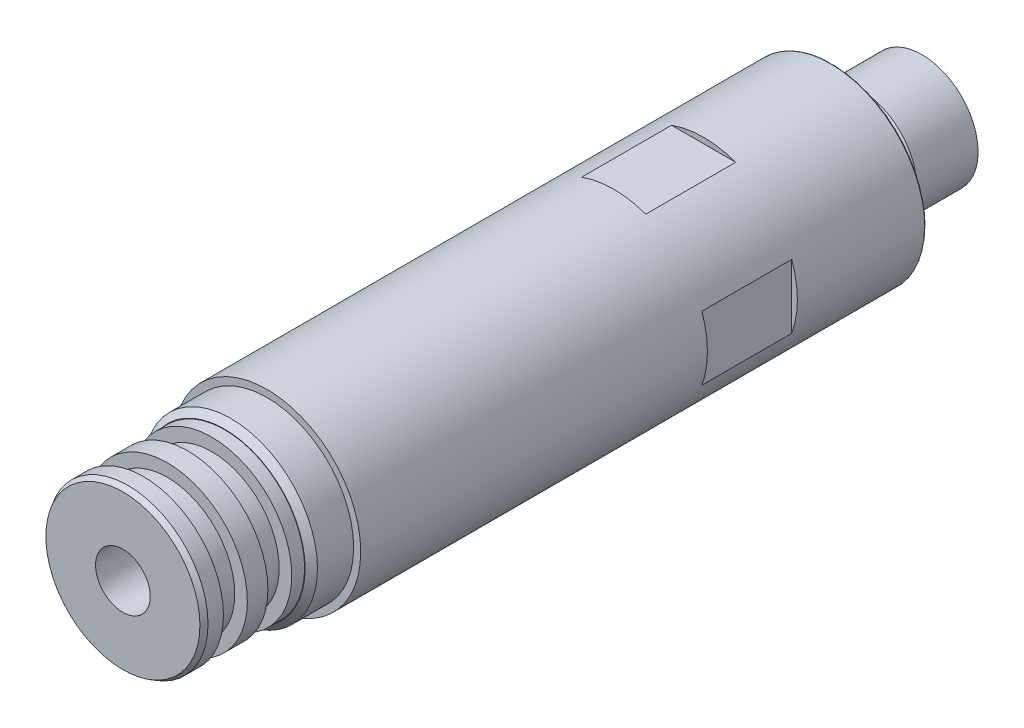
ISO-10303-21;
HEADER;
FILE_DESCRIPTION(('STEP AP214'),'2;1');
FILE_NAME('part.step','',(''),(''),'','','');
FILE_SCHEMA(('AUTOMOTIVE_DESIGN { 1 0 10303 214 1 1 1 1 }'));
ENDSEC;
DATA;
#1=APPLICATION_CONTEXT('core data for automotive mechanical design processes');
#2=APPLICATION_PROTOCOL_DEFINITION('international standard','automotive_design',2000,#1);
#3=PRODUCT_CONTEXT('',#1,'mechanical');
#4=PRODUCT('Part','Part','',(#3));
#5=PRODUCT_RELATED_PRODUCT_CATEGORY('part','',(#4));
#6=PRODUCT_DEFINITION_FORMATION('','',#4);
#7=PRODUCT_DEFINITION_CONTEXT('part definition',#1,'design');
#8=PRODUCT_DEFINITION('design','',#6,#7);
#9=PRODUCT_DEFINITION_SHAPE('','',#8);
#10=(LENGTH_UNIT() NAMED_UNIT(*) SI_UNIT(.MILLI.,.METRE.));
#11=(NAMED_UNIT(*) PLANE_ANGLE_UNIT() SI_UNIT($,.RADIAN.));
#12=(NAMED_UNIT(*) SI_UNIT($,.STERADIAN.) SOLID_ANGLE_UNIT());
#13=UNCERTAINTY_MEASURE_WITH_UNIT(LENGTH_MEASURE(1.E-05),#10,'distance_accuracy_value','');
#14=(GEOMETRIC_REPRESENTATION_CONTEXT(3) GLOBAL_UNCERTAINTY_ASSIGNED_CONTEXT((#13)) GLOBAL_UNIT_ASSIGNED_CONTEXT((#10,
#11,#12)) REPRESENTATION_CONTEXT('',''));
#15=CARTESIAN_POINT('',(0.,0.,0.));
#16=DIRECTION('',(0.,0.,1.));
#17=DIRECTION('',(1.,0.,0.));
#18=AXIS2_PLACEMENT_3D('',#15,#16,#17);
#19=CARTESIAN_POINT('',(0.,0.,65.7352));
#20=DIRECTION('',(0.,0.,-1.));
#21=DIRECTION('',(-1.,0.,0.));
#22=AXIS2_PLACEMENT_3D('',#19,#20,#21);
#23=CYLINDRICAL_SURFACE('',#22,1.5875);
#24=CARTESIAN_POINT('',(0.,0.,-8.89));
#25=DIRECTION('',(0.,0.,-1.));
#26=DIRECTION('',(-1.,0.,0.));
#27=AXIS2_PLACEMENT_3D('',#24,#25,#26);
#28=CIRCLE('',#27,1.5875);
#29=CARTESIAN_POINT('',(-1.5875,0.,-8.89));
#30=VERTEX_POINT('',#29);
#31=EDGE_CURVE('E304',#30,#30,#28,.T.);
#32=ORIENTED_EDGE('',*,*,#31,.T.);
#33=EDGE_LOOP('',(#32));
#34=FACE_BOUND('',#33,.T.);
#35=CARTESIAN_POINT('',(0.,0.,54.8894));
#36=DIRECTION('',(0.,0.,1.));
#37=DIRECTION('',(1.,0.,0.));
#38=AXIS2_PLACEMENT_3D('',#35,#36,#37);
#39=CIRCLE('',#38,1.5875);
#40=CARTESIAN_POINT('',(1.5875,0.,54.8894));
#41=VERTEX_POINT('',#40);
#42=EDGE_CURVE('E280',#41,#41,#39,.F.);
#43=ORIENTED_EDGE('',*,*,#42,.F.);
#44=EDGE_LOOP('',(#43));
#45=FACE_BOUND('',#44,.T.);
#46=ADVANCED_FACE('F36',(#34,#45),#23,.F.);
#47=CARTESIAN_POINT('',(0.,0.,65.7352));
#48=DIRECTION('',(0.,0.,1.));
#49=DIRECTION('',(1.,0.,0.));
#50=AXIS2_PLACEMENT_3D('',#47,#48,#49);
#51=PLANE('',#50);
#52=CARTESIAN_POINT('',(0.,0.,65.7352));
#53=DIRECTION('',(0.,0.,1.));
#54=DIRECTION('',(1.,0.,0.));
#55=AXIS2_PLACEMENT_3D('',#52,#53,#54);
#56=CIRCLE('',#55,7.9121);
#57=CARTESIAN_POINT('',(7.91210000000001,0.,65.7352));
#58=VERTEX_POINT('',#57);
#59=EDGE_CURVE('E309',#58,#58,#56,.T.);
#60=ORIENTED_EDGE('',*,*,#59,.T.);
#61=EDGE_LOOP('',(#60));
#62=FACE_BOUND('',#61,.T.);
#63=CARTESIAN_POINT('',(0.,0.,65.7352));
#64=DIRECTION('',(0.,0.,1.));
#65=DIRECTION('',(1.,0.,0.));
#66=AXIS2_PLACEMENT_3D('',#63,#64,#65);
#67=CIRCLE('',#66,6.6675);
#68=CARTESIAN_POINT('',(6.66750000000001,0.,65.7352));
#69=VERTEX_POINT('',#68);
#70=EDGE_CURVE('E287',#69,#69,#67,.T.);
#71=ORIENTED_EDGE('',*,*,#70,.F.);
#72=EDGE_LOOP('',(#71));
#73=FACE_BOUND('',#72,.T.);
#74=ADVANCED_FACE('F198',(#62,#73),#51,.T.);
#75=CARTESIAN_POINT('',(0.,0.,61.341));
#76=DIRECTION('',(0.,0.,1.));
#77=DIRECTION('',(1.,0.,0.));
#78=AXIS2_PLACEMENT_3D('',#75,#76,#77);
#79=PLANE('',#78);
#80=CARTESIAN_POINT('',(0.,0.,61.341));
#81=DIRECTION('',(0.,0.,1.));
#82=DIRECTION('',(1.,0.,0.));
#83=AXIS2_PLACEMENT_3D('',#80,#81,#82);
#84=CIRCLE('',#83,7.9121);
#85=CARTESIAN_POINT('',(7.91210000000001,0.,61.341));
#86=VERTEX_POINT('',#85);
#87=EDGE_CURVE('E265',#86,#86,#84,.T.);
#88=ORIENTED_EDGE('',*,*,#87,.T.);
#89=EDGE_LOOP('',(#88));
#90=FACE_BOUND('',#89,.T.);
#91=CARTESIAN_POINT('',(0.,0.,61.341));
#92=DIRECTION('',(0.,0.,1.));
#93=DIRECTION('',(1.,0.,0.));
#94=AXIS2_PLACEMENT_3D('',#91,#92,#93);
#95=CIRCLE('',#94,6.6675);
#96=CARTESIAN_POINT('',(6.66750000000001,0.,61.341));
#97=VERTEX_POINT('',#96);
#98=EDGE_CURVE('E312',#97,#97,#95,.T.);
#99=ORIENTED_EDGE('',*,*,#98,.F.);
#100=EDGE_LOOP('',(#99));
#101=FACE_BOUND('',#100,.T.);
#102=ADVANCED_FACE('F204',(#90,#101),#79,.T.);
#103=CARTESIAN_POINT('',(0.,0.,60.071));
#104=DIRECTION('',(0.,0.,1.));
#105=DIRECTION('',(1.,0.,0.));
#106=AXIS2_PLACEMENT_3D('',#103,#104,#105);
#107=PLANE('',#106);
#108=CARTESIAN_POINT('',(0.,0.,60.071));
#109=DIRECTION('',(0.,0.,1.));
#110=DIRECTION('',(1.,0.,0.));
#111=AXIS2_PLACEMENT_3D('',#108,#109,#110);
#112=CIRCLE('',#111,7.9629);
#113=CARTESIAN_POINT('',(7.96290000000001,0.,60.071));
#114=VERTEX_POINT('',#113);
#115=EDGE_CURVE('E160',#114,#114,#112,.T.);
#116=ORIENTED_EDGE('',*,*,#115,.T.);
#117=EDGE_LOOP('',(#116));
#118=FACE_BOUND('',#117,.T.);
#119=CARTESIAN_POINT('',(0.,0.,60.071));
#120=DIRECTION('',(0.,0.,1.));
#121=DIRECTION('',(1.,0.,0.));
#122=AXIS2_PLACEMENT_3D('',#119,#120,#121);
#123=CIRCLE('',#122,7.9121);
#124=CARTESIAN_POINT('',(7.91210000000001,0.,60.071));
#125=VERTEX_POINT('',#124);
#126=EDGE_CURVE('E270',#125,#125,#123,.T.);
#127=ORIENTED_EDGE('',*,*,#126,.F.);
#128=EDGE_LOOP('',(#127));
#129=FACE_BOUND('',#128,.T.);
#130=ADVANCED_FACE('F228',(#118,#129),#107,.T.);
#131=CARTESIAN_POINT('',(0.,0.,55.88));
#132=DIRECTION('',(0.,0.,1.));
#133=DIRECTION('',(1.,0.,0.));
#134=AXIS2_PLACEMENT_3D('',#131,#132,#133);
#135=PLANE('',#134);
#136=CARTESIAN_POINT('',(0.,0.,55.88));
#137=DIRECTION('',(0.,0.,1.));
#138=DIRECTION('',(1.,0.,0.));
#139=AXIS2_PLACEMENT_3D('',#136,#137,#138);
#140=CIRCLE('',#139,9.271);
#141=CARTESIAN_POINT('',(9.27100000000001,0.,55.88));
#142=VERTEX_POINT('',#141);
#143=EDGE_CURVE('E259',#142,#142,#140,.T.);
#144=ORIENTED_EDGE('',*,*,#143,.T.);
#145=EDGE_LOOP('',(#144));
#146=FACE_BOUND('',#145,.T.);
#147=CARTESIAN_POINT('',(0.,0.,55.88));
#148=DIRECTION('',(0.,0.,1.));
#149=DIRECTION('',(1.,0.,0.));
#150=AXIS2_PLACEMENT_3D('',#147,#148,#149);
#151=CIRCLE('',#150,8.5725);
#152=CARTESIAN_POINT('',(8.57250000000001,0.,55.88));
#153=VERTEX_POINT('',#152);
#154=EDGE_CURVE('E262',#153,#153,#151,.T.);
#155=ORIENTED_EDGE('',*,*,#154,.F.);
#156=EDGE_LOOP('',(#155));
#157=FACE_BOUND('',#156,.T.);
#158=ADVANCED_FACE('F236',(#146,#157),#135,.T.);
#159=CARTESIAN_POINT('',(0.,0.,0.));
#160=DIRECTION('',(0.,0.,1.));
#161=DIRECTION('',(1.,0.,0.));
#162=AXIS2_PLACEMENT_3D('',#159,#160,#161);
#163=PLANE('',#162);
#164=CARTESIAN_POINT('',(0.,0.,0.));
#165=DIRECTION('',(0.,0.,1.));
#166=DIRECTION('',(1.,0.,0.));
#167=AXIS2_PLACEMENT_3D('',#164,#165,#166);
#168=CIRCLE('',#167,9.144);
#169=CARTESIAN_POINT('',(9.14400000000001,0.,0.));
#170=VERTEX_POINT('',#169);
#171=EDGE_CURVE('E12',#170,#170,#168,.F.);
#172=ORIENTED_EDGE('',*,*,#171,.T.);
#173=EDGE_LOOP('',(#172));
#174=FACE_BOUND('',#173,.T.);
#175=CARTESIAN_POINT('',(0.,0.,0.));
#176=DIRECTION('',(0.,0.,1.));
#177=DIRECTION('',(1.,0.,0.));
#178=AXIS2_PLACEMENT_3D('',#175,#176,#177);
#179=CIRCLE('',#178,5.2578);
#180=CARTESIAN_POINT('',(5.25780000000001,0.,0.));
#181=VERTEX_POINT('',#180);
#182=EDGE_CURVE('E169',#181,#181,#179,.T.);
#183=ORIENTED_EDGE('',*,*,#182,.T.);
#184=EDGE_LOOP('',(#183));
#185=FACE_BOUND('',#184,.T.);
#186=ADVANCED_FACE('F249',(#174,#185),#163,.F.);
#187=CARTESIAN_POINT('',(0.,0.,55.88));
#188=DIRECTION('',(0.,0.,-1.));
#189=DIRECTION('',(-1.,0.,0.));
#190=AXIS2_PLACEMENT_3D('',#187,#188,#189);
#191=CYLINDRICAL_SURFACE('',#190,9.271);
#192=CARTESIAN_POINT('',(0.,0.,0.127000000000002));
#193=DIRECTION('',(0.,0.,1.));
#194=DIRECTION('',(1.,0.,0.));
#195=AXIS2_PLACEMENT_3D('',#192,#193,#194);
#196=CIRCLE('',#195,9.271);
#197=CARTESIAN_POINT('',(9.27100000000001,0.,0.127000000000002));
#198=VERTEX_POINT('',#197);
#199=EDGE_CURVE('E44',#198,#198,#196,.T.);
#200=ORIENTED_EDGE('',*,*,#199,.T.);
#201=EDGE_LOOP('',(#200));
#202=FACE_BOUND('',#201,.T.);
#203=CARTESIAN_POINT('',(0.,0.,21.59));
#204=DIRECTION('',(0.,0.,1.));
#205=DIRECTION('',(1.,0.,0.));
#206=AXIS2_PLACEMENT_3D('',#203,#204,#205);
#207=CIRCLE('',#206,9.271);
#208=CARTESIAN_POINT('',(-8.71220000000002,3.17001769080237,21.59));
#209=VERTEX_POINT('',#208);
#210=CARTESIAN_POINT('',(-8.71220000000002,-3.17001769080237,21.59));
#211=VERTEX_POINT('',#210);
#212=EDGE_CURVE('E126',#209,#211,#207,.T.);
#213=ORIENTED_EDGE('',*,*,#212,.T.);
#214=DIRECTION('',(0.,0.,-1.));
#215=VECTOR('',#214,1.);
#216=CARTESIAN_POINT('',(-8.71220000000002,-3.17001769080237,55.88));
#217=LINE('',#216,#215);
#218=CARTESIAN_POINT('',(-8.71220000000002,-3.17001769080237,12.7));
#219=VERTEX_POINT('',#218);
#220=EDGE_CURVE('E157',#211,#219,#217,.T.);
#221=ORIENTED_EDGE('',*,*,#220,.T.);
#222=CARTESIAN_POINT('',(0.,0.,12.7));
#223=DIRECTION('',(0.,0.,1.));
#224=DIRECTION('',(1.,0.,0.));
#225=AXIS2_PLACEMENT_3D('',#222,#223,#224);
#226=CIRCLE('',#225,9.271);
#227=CARTESIAN_POINT('',(-8.71220000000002,3.17001769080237,12.7));
#228=VERTEX_POINT('',#227);
#229=EDGE_CURVE('E123',#228,#219,#226,.T.);
#230=ORIENTED_EDGE('',*,*,#229,.F.);
#231=DIRECTION('',(0.,0.,-1.));
#232=VECTOR('',#231,1.);
#233=CARTESIAN_POINT('',(-8.71220000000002,3.17001769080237,55.88));
#234=LINE('',#233,#232);
#235=EDGE_CURVE('E128',#228,#209,#234,.F.);
#236=ORIENTED_EDGE('',*,*,#235,.T.);
#237=EDGE_LOOP('',(#213,#221,#230,#236));
#238=FACE_BOUND('',#237,.T.);
#239=CARTESIAN_POINT('',(-3.17001769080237,-8.71220000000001,21.59));
#240=VERTEX_POINT('',#239);
#241=CARTESIAN_POINT('',(3.17001769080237,-8.71220000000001,21.59));
#242=VERTEX_POINT('',#241);
#243=EDGE_CURVE('E137',#240,#242,#207,.T.);
#244=ORIENTED_EDGE('',*,*,#243,.T.);
#245=DIRECTION('',(0.,0.,-1.));
#246=VECTOR('',#245,1.);
#247=CARTESIAN_POINT('',(3.17001769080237,-8.71220000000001,55.88));
#248=LINE('',#247,#246);
#249=CARTESIAN_POINT('',(3.17001769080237,-8.71220000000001,12.7));
#250=VERTEX_POINT('',#249);
#251=EDGE_CURVE('E146',#242,#250,#248,.T.);
#252=ORIENTED_EDGE('',*,*,#251,.T.);
#253=CARTESIAN_POINT('',(-3.17001769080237,-8.71220000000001,12.7));
#254=VERTEX_POINT('',#253);
#255=EDGE_CURVE('E129',#254,#250,#226,.T.);
#256=ORIENTED_EDGE('',*,*,#255,.F.);
#257=DIRECTION('',(0.,0.,-1.));
#258=VECTOR('',#257,1.);
#259=CARTESIAN_POINT('',(-3.17001769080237,-8.71220000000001,55.88));
#260=LINE('',#259,#258);
#261=EDGE_CURVE('E140',#254,#240,#260,.F.);
#262=ORIENTED_EDGE('',*,*,#261,.T.);
#263=EDGE_LOOP('',(#244,#252,#256,#262));
#264=FACE_BOUND('',#263,.T.);
#265=CARTESIAN_POINT('',(8.7122,-3.17001769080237,21.59));
#266=VERTEX_POINT('',#265);
#267=CARTESIAN_POINT('',(8.7122,3.17001769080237,21.59));
#268=VERTEX_POINT('',#267);
#269=EDGE_CURVE('E127',#266,#268,#207,.T.);
#270=ORIENTED_EDGE('',*,*,#269,.T.);
#271=DIRECTION('',(0.,0.,-1.));
#272=VECTOR('',#271,1.);
#273=CARTESIAN_POINT('',(8.7122,3.17001769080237,55.88));
#274=LINE('',#273,#272);
#275=CARTESIAN_POINT('',(8.7122,3.17001769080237,12.7));
#276=VERTEX_POINT('',#275);
#277=EDGE_CURVE('E136',#268,#276,#274,.T.);
#278=ORIENTED_EDGE('',*,*,#277,.T.);
#279=CARTESIAN_POINT('',(8.7122,-3.17001769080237,12.7));
#280=VERTEX_POINT('',#279);
#281=EDGE_CURVE('E124',#280,#276,#226,.T.);
#282=ORIENTED_EDGE('',*,*,#281,.F.);
#283=DIRECTION('',(0.,0.,-1.));
#284=VECTOR('',#283,1.);
#285=CARTESIAN_POINT('',(8.7122,-3.17001769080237,55.88));
#286=LINE('',#285,#284);
#287=EDGE_CURVE('E130',#280,#266,#286,.F.);
#288=ORIENTED_EDGE('',*,*,#287,.T.);
#289=EDGE_LOOP('',(#270,#278,#282,#288));
#290=FACE_BOUND('',#289,.T.);
#291=CARTESIAN_POINT('',(3.17001769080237,8.71220000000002,21.59));
#292=VERTEX_POINT('',#291);
#293=CARTESIAN_POINT('',(-3.17001769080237,8.71220000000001,21.59));
#294=VERTEX_POINT('',#293);
#295=EDGE_CURVE('E121',#292,#294,#207,.T.);
#296=ORIENTED_EDGE('',*,*,#295,.T.);
#297=DIRECTION('',(0.,0.,-1.));
#298=VECTOR('',#297,1.);
#299=CARTESIAN_POINT('',(-3.17001769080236,8.71220000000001,55.88));
#300=LINE('',#299,#298);
#301=CARTESIAN_POINT('',(-3.17001769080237,8.7122,12.7));
#302=VERTEX_POINT('',#301);
#303=EDGE_CURVE('E120',#294,#302,#300,.T.);
#304=ORIENTED_EDGE('',*,*,#303,.T.);
#305=CARTESIAN_POINT('',(3.17001769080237,8.71220000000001,12.7));
#306=VERTEX_POINT('',#305);
#307=EDGE_CURVE('E112',#306,#302,#226,.T.);
#308=ORIENTED_EDGE('',*,*,#307,.F.);
#309=DIRECTION('',(0.,0.,-1.));
#310=VECTOR('',#309,1.);
#311=CARTESIAN_POINT('',(3.17001769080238,8.71220000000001,55.88));
#312=LINE('',#311,#310);
#313=EDGE_CURVE('E101',#306,#292,#312,.F.);
#314=ORIENTED_EDGE('',*,*,#313,.T.);
#315=EDGE_LOOP('',(#296,#304,#308,#314));
#316=FACE_BOUND('',#315,.T.);
#317=ORIENTED_EDGE('',*,*,#143,.F.);
#318=EDGE_LOOP('',(#317));
#319=FACE_BOUND('',#318,.T.);
#320=ADVANCED_FACE('F38',(#202,#238,#264,#290,#316,#319),#191,.T.);
#321=CARTESIAN_POINT('',(0.,0.,-8.89));
#322=DIRECTION('',(0.,0.,1.));
#323=DIRECTION('',(1.,0.,0.));
#324=AXIS2_PLACEMENT_3D('',#321,#322,#323);
#325=CYLINDRICAL_SURFACE('',#324,5.55625);
#326=CARTESIAN_POINT('',(0.,0.,-2.8321));
#327=DIRECTION('',(0.,0.,-1.));
#328=DIRECTION('',(-1.,0.,0.));
#329=AXIS2_PLACEMENT_3D('',#326,#327,#328);
#330=CIRCLE('',#329,5.55625);
#331=CARTESIAN_POINT('',(-5.55625000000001,0.,-2.8321));
#332=VERTEX_POINT('',#331);
#333=EDGE_CURVE('E172',#332,#332,#330,.T.);
#334=ORIENTED_EDGE('',*,*,#333,.T.);
#335=EDGE_LOOP('',(#334));
#336=FACE_BOUND('',#335,.T.);
#337=CARTESIAN_POINT('',(0.,0.,-8.89));
#338=DIRECTION('',(0.,0.,-1.));
#339=DIRECTION('',(-1.,0.,0.));
#340=AXIS2_PLACEMENT_3D('',#337,#338,#339);
#341=CIRCLE('',#340,5.55625);
#342=CARTESIAN_POINT('',(-5.55625000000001,0.,-8.89));
#343=VERTEX_POINT('',#342);
#344=EDGE_CURVE('E264',#343,#343,#341,.T.);
#345=ORIENTED_EDGE('',*,*,#344,.F.);
#346=EDGE_LOOP('',(#345));
#347=FACE_BOUND('',#346,.T.);
#348=ADVANCED_FACE('F244',(#336,#347),#325,.T.);
#349=CARTESIAN_POINT('',(0.,0.,-8.89));
#350=DIRECTION('',(0.,0.,-1.));
#351=DIRECTION('',(-1.,0.,0.));
#352=AXIS2_PLACEMENT_3D('',#349,#350,#351);
#353=PLANE('',#352);
#354=ORIENTED_EDGE('',*,*,#31,.F.);
#355=EDGE_LOOP('',(#354));
#356=FACE_BOUND('',#355,.T.);
#357=ORIENTED_EDGE('',*,*,#344,.T.);
#358=EDGE_LOOP('',(#357));
#359=FACE_BOUND('',#358,.T.);
#360=ADVANCED_FACE('F240',(#356,#359),#353,.T.);
#361=CARTESIAN_POINT('',(0.,0.,57.15));
#362=DIRECTION('',(0.,0.,-1.));
#363=DIRECTION('',(-1.,0.,0.));
#364=AXIS2_PLACEMENT_3D('',#361,#362,#363);
#365=CYLINDRICAL_SURFACE('',#364,8.5725);
#366=CARTESIAN_POINT('',(0.,0.,59.4614));
#367=DIRECTION('',(0.,0.,1.));
#368=DIRECTION('',(1.,0.,0.));
#369=AXIS2_PLACEMENT_3D('',#366,#367,#368);
#370=CIRCLE('',#369,8.5725);
#371=CARTESIAN_POINT('',(8.57250000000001,0.,59.4614));
#372=VERTEX_POINT('',#371);
#373=EDGE_CURVE('E163',#372,#372,#370,.F.);
#374=ORIENTED_EDGE('',*,*,#373,.T.);
#375=EDGE_LOOP('',(#374));
#376=FACE_BOUND('',#375,.T.);
#377=ORIENTED_EDGE('',*,*,#154,.T.);
#378=EDGE_LOOP('',(#377));
#379=FACE_BOUND('',#378,.T.);
#380=ADVANCED_FACE('F232',(#376,#379),#365,.T.);
#381=CARTESIAN_POINT('',(0.,0.,61.341));
#382=DIRECTION('',(0.,0.,-1.));
#383=DIRECTION('',(-1.,0.,0.));
#384=AXIS2_PLACEMENT_3D('',#381,#382,#383);
#385=CYLINDRICAL_SURFACE('',#384,7.9121);
#386=ORIENTED_EDGE('',*,*,#87,.F.);
#387=EDGE_LOOP('',(#386));
#388=FACE_BOUND('',#387,.T.);
#389=ORIENTED_EDGE('',*,*,#126,.T.);
#390=EDGE_LOOP('',(#389));
#391=FACE_BOUND('',#390,.T.);
#392=ADVANCED_FACE('F224',(#388,#391),#385,.T.);
#393=CARTESIAN_POINT('',(0.,0.,63.7032));
#394=DIRECTION('',(0.,0.,-1.));
#395=DIRECTION('',(-1.,0.,0.));
#396=AXIS2_PLACEMENT_3D('',#393,#394,#395);
#397=CYLINDRICAL_SURFACE('',#396,6.6675);
#398=CARTESIAN_POINT('',(0.,0.,63.7032));
#399=DIRECTION('',(0.,0.,1.));
#400=DIRECTION('',(1.,0.,0.));
#401=AXIS2_PLACEMENT_3D('',#398,#399,#400);
#402=CIRCLE('',#401,6.6675);
#403=CARTESIAN_POINT('',(6.66750000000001,0.,63.7032));
#404=VERTEX_POINT('',#403);
#405=EDGE_CURVE('E315',#404,#404,#402,.T.);
#406=ORIENTED_EDGE('',*,*,#405,.F.);
#407=EDGE_LOOP('',(#406));
#408=FACE_BOUND('',#407,.T.);
#409=ORIENTED_EDGE('',*,*,#98,.T.);
#410=EDGE_LOOP('',(#409));
#411=FACE_BOUND('',#410,.T.);
#412=ADVANCED_FACE('F216',(#408,#411),#397,.T.);
#413=CARTESIAN_POINT('',(0.,0.,63.7032));
#414=DIRECTION('',(0.,0.,1.));
#415=DIRECTION('',(1.,0.,0.));
#416=AXIS2_PLACEMENT_3D('',#413,#414,#415);
#417=PLANE('',#416);
#418=CARTESIAN_POINT('',(0.,0.,63.7032));
#419=DIRECTION('',(0.,0.,1.));
#420=DIRECTION('',(1.,0.,0.));
#421=AXIS2_PLACEMENT_3D('',#418,#419,#420);
#422=CIRCLE('',#421,7.9121);
#423=CARTESIAN_POINT('',(7.91210000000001,0.,63.7032));
#424=VERTEX_POINT('',#423);
#425=EDGE_CURVE('E306',#424,#424,#422,.T.);
#426=ORIENTED_EDGE('',*,*,#425,.F.);
#427=EDGE_LOOP('',(#426));
#428=FACE_BOUND('',#427,.T.);
#429=ORIENTED_EDGE('',*,*,#405,.T.);
#430=EDGE_LOOP('',(#429));
#431=FACE_BOUND('',#430,.T.);
#432=ADVANCED_FACE('F213',(#428,#431),#417,.F.);
#433=CARTESIAN_POINT('',(0.,0.,65.7352));
#434=DIRECTION('',(0.,0.,-1.));
#435=DIRECTION('',(-1.,0.,0.));
#436=AXIS2_PLACEMENT_3D('',#433,#434,#435);
#437=CYLINDRICAL_SURFACE('',#436,7.9121);
#438=ORIENTED_EDGE('',*,*,#59,.F.);
#439=EDGE_LOOP('',(#438));
#440=FACE_BOUND('',#439,.T.);
#441=ORIENTED_EDGE('',*,*,#425,.T.);
#442=EDGE_LOOP('',(#441));
#443=FACE_BOUND('',#442,.T.);
#444=ADVANCED_FACE('F215',(#440,#443),#437,.T.);
#445=CARTESIAN_POINT('',(0.,0.,68.0974));
#446=DIRECTION('',(0.,0.,-1.));
#447=DIRECTION('',(-1.,0.,0.));
#448=AXIS2_PLACEMENT_3D('',#445,#446,#447);
#449=CYLINDRICAL_SURFACE('',#448,6.6675);
#450=CARTESIAN_POINT('',(0.,0.,68.0974));
#451=DIRECTION('',(0.,0.,1.));
#452=DIRECTION('',(1.,0.,0.));
#453=AXIS2_PLACEMENT_3D('',#450,#451,#452);
#454=CIRCLE('',#453,6.6675);
#455=CARTESIAN_POINT('',(6.66750000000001,0.,68.0974));
#456=VERTEX_POINT('',#455);
#457=EDGE_CURVE('E301',#456,#456,#454,.T.);
#458=ORIENTED_EDGE('',*,*,#457,.F.);
#459=EDGE_LOOP('',(#458));
#460=FACE_BOUND('',#459,.T.);
#461=ORIENTED_EDGE('',*,*,#70,.T.);
#462=EDGE_LOOP('',(#461));
#463=FACE_BOUND('',#462,.T.);
#464=ADVANCED_FACE('F211',(#460,#463),#449,.T.);
#465=CARTESIAN_POINT('',(0.,0.,68.0974));
#466=DIRECTION('',(0.,0.,1.));
#467=DIRECTION('',(1.,0.,0.));
#468=AXIS2_PLACEMENT_3D('',#465,#466,#467);
#469=PLANE('',#468);
#470=CARTESIAN_POINT('',(0.,0.,68.0974));
#471=DIRECTION('',(0.,0.,1.));
#472=DIRECTION('',(1.,0.,0.));
#473=AXIS2_PLACEMENT_3D('',#470,#471,#472);
#474=CIRCLE('',#473,7.9121);
#475=CARTESIAN_POINT('',(7.91210000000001,0.,68.0974));
#476=VERTEX_POINT('',#475);
#477=EDGE_CURVE('E282',#476,#476,#474,.T.);
#478=ORIENTED_EDGE('',*,*,#477,.F.);
#479=EDGE_LOOP('',(#478));
#480=FACE_BOUND('',#479,.T.);
#481=ORIENTED_EDGE('',*,*,#457,.T.);
#482=EDGE_LOOP('',(#481));
#483=FACE_BOUND('',#482,.T.);
#484=ADVANCED_FACE('F333',(#480,#483),#469,.F.);
#485=CARTESIAN_POINT('',(0.,0.,70.1294));
#486=DIRECTION('',(0.,0.,-1.));
#487=DIRECTION('',(-1.,0.,0.));
#488=AXIS2_PLACEMENT_3D('',#485,#486,#487);
#489=CYLINDRICAL_SURFACE('',#488,7.9121);
#490=CARTESIAN_POINT('',(0.,0.,69.6214));
#491=DIRECTION('',(0.,0.,1.));
#492=DIRECTION('',(1.,0.,0.));
#493=AXIS2_PLACEMENT_3D('',#490,#491,#492);
#494=CIRCLE('',#493,7.9121);
#495=CARTESIAN_POINT('',(7.91210000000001,0.,69.6214));
#496=VERTEX_POINT('',#495);
#497=EDGE_CURVE('E113',#496,#496,#494,.F.);
#498=ORIENTED_EDGE('',*,*,#497,.T.);
#499=EDGE_LOOP('',(#498));
#500=FACE_BOUND('',#499,.T.);
#501=ORIENTED_EDGE('',*,*,#477,.T.);
#502=EDGE_LOOP('',(#501));
#503=FACE_BOUND('',#502,.T.);
#504=ADVANCED_FACE('F338',(#500,#503),#489,.T.);
#505=CARTESIAN_POINT('',(0.,0.,70.1294));
#506=DIRECTION('',(0.,0.,1.));
#507=DIRECTION('',(1.,0.,0.));
#508=AXIS2_PLACEMENT_3D('',#505,#506,#507);
#509=PLANE('',#508);
#510=CARTESIAN_POINT('',(0.,0.,70.1294));
#511=DIRECTION('',(0.,0.,1.));
#512=DIRECTION('',(1.,0.,0.));
#513=AXIS2_PLACEMENT_3D('',#510,#511,#512);
#514=CIRCLE('',#513,2.7051);
#515=CARTESIAN_POINT('',(2.7051,0.,70.1294));
#516=VERTEX_POINT('',#515);
#517=EDGE_CURVE('E290',#516,#516,#514,.T.);
#518=ORIENTED_EDGE('',*,*,#517,.F.);
#519=EDGE_LOOP('',(#518));
#520=FACE_BOUND('',#519,.T.);
#521=CARTESIAN_POINT('',(0.,0.,70.1294));
#522=DIRECTION('',(0.,0.,1.));
#523=DIRECTION('',(1.,0.,0.));
#524=AXIS2_PLACEMENT_3D('',#521,#522,#523);
#525=CIRCLE('',#524,7.61880606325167);
#526=CARTESIAN_POINT('',(7.61880606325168,0.,70.1294));
#527=VERTEX_POINT('',#526);
#528=EDGE_CURVE('E275',#527,#527,#525,.T.);
#529=ORIENTED_EDGE('',*,*,#528,.T.);
#530=EDGE_LOOP('',(#529));
#531=FACE_BOUND('',#530,.T.);
#532=ADVANCED_FACE('F346',(#520,#531),#509,.T.);
#533=CARTESIAN_POINT('',(0.,0.,70.1294));
#534=DIRECTION('',(0.,0.,-1.));
#535=DIRECTION('',(-1.,0.,0.));
#536=AXIS2_PLACEMENT_3D('',#533,#534,#535);
#537=CONICAL_SURFACE('',#536,7.61880606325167,0.52359877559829);
#538=ORIENTED_EDGE('',*,*,#497,.F.);
#539=EDGE_LOOP('',(#538));
#540=FACE_BOUND('',#539,.T.);
#541=ORIENTED_EDGE('',*,*,#528,.F.);
#542=EDGE_LOOP('',(#541));
#543=FACE_BOUND('',#542,.T.);
#544=ADVANCED_FACE('F351',(#540,#543),#537,.T.);
#545=CARTESIAN_POINT('',(0.,0.,54.8894));
#546=DIRECTION('',(0.,0.,1.));
#547=DIRECTION('',(1.,0.,0.));
#548=AXIS2_PLACEMENT_3D('',#545,#546,#547);
#549=PLANE('',#548);
#550=CARTESIAN_POINT('',(0.,0.,54.8894));
#551=DIRECTION('',(0.,0.,1.));
#552=DIRECTION('',(1.,0.,0.));
#553=AXIS2_PLACEMENT_3D('',#550,#551,#552);
#554=CIRCLE('',#553,2.7051);
#555=CARTESIAN_POINT('',(2.7051,0.,54.8894));
#556=VERTEX_POINT('',#555);
#557=EDGE_CURVE('E283',#556,#556,#554,.T.);
#558=ORIENTED_EDGE('',*,*,#557,.T.);
#559=EDGE_LOOP('',(#558));
#560=FACE_BOUND('',#559,.T.);
#561=ORIENTED_EDGE('',*,*,#42,.T.);
#562=EDGE_LOOP('',(#561));
#563=FACE_BOUND('',#562,.T.);
#564=ADVANCED_FACE('F358',(#560,#563),#549,.T.);
#565=CARTESIAN_POINT('',(0.,0.,54.8894));
#566=DIRECTION('',(0.,0.,1.));
#567=DIRECTION('',(1.,0.,0.));
#568=AXIS2_PLACEMENT_3D('',#565,#566,#567);
#569=CYLINDRICAL_SURFACE('',#568,2.7051);
#570=CARTESIAN_POINT('',(2.7051,0.,54.8894));
#571=CARTESIAN_POINT('',(2.7051,0.,55.04815));
#572=CARTESIAN_POINT('',(2.7051,0.,55.2069));
#573=CARTESIAN_POINT('',(2.7051,0.,55.5244));
#574=CARTESIAN_POINT('',(2.7051,0.,55.68315));
#575=CARTESIAN_POINT('',(2.7051,0.,56.00065));
#576=CARTESIAN_POINT('',(2.7051,0.,56.1594));
#577=CARTESIAN_POINT('',(2.7051,0.,56.4769));
#578=CARTESIAN_POINT('',(2.7051,0.,56.63565));
#579=CARTESIAN_POINT('',(2.7051,0.,56.95315));
#580=CARTESIAN_POINT('',(2.7051,0.,57.1119));
#581=CARTESIAN_POINT('',(2.7051,0.,57.4294));
#582=CARTESIAN_POINT('',(2.7051,0.,57.58815));
#583=CARTESIAN_POINT('',(2.7051,0.,57.90565));
#584=CARTESIAN_POINT('',(2.7051,0.,58.0644));
#585=CARTESIAN_POINT('',(2.7051,0.,58.3819));
#586=CARTESIAN_POINT('',(2.7051,0.,58.54065));
#587=CARTESIAN_POINT('',(2.7051,0.,58.85815));
#588=CARTESIAN_POINT('',(2.7051,0.,59.0169));
#589=CARTESIAN_POINT('',(2.7051,0.,59.3344));
#590=CARTESIAN_POINT('',(2.7051,0.,59.49315));
#591=CARTESIAN_POINT('',(2.7051,0.,59.81065));
#592=CARTESIAN_POINT('',(2.7051,0.,59.9694));
#593=CARTESIAN_POINT('',(2.7051,0.,60.2869));
#594=CARTESIAN_POINT('',(2.7051,0.,60.44565));
#595=CARTESIAN_POINT('',(2.7051,0.,60.76315));
#596=CARTESIAN_POINT('',(2.7051,0.,60.9219));
#597=CARTESIAN_POINT('',(2.7051,0.,61.2394));
#598=CARTESIAN_POINT('',(2.7051,0.,61.39815));
#599=CARTESIAN_POINT('',(2.7051,0.,61.71565));
#600=CARTESIAN_POINT('',(2.7051,0.,61.8744));
#601=CARTESIAN_POINT('',(2.7051,0.,62.1919));
#602=CARTESIAN_POINT('',(2.7051,0.,62.35065));
#603=CARTESIAN_POINT('',(2.7051,0.,62.66815));
#604=CARTESIAN_POINT('',(2.7051,0.,62.8269));
#605=CARTESIAN_POINT('',(2.7051,0.,63.1444));
#606=CARTESIAN_POINT('',(2.7051,0.,63.30315));
#607=CARTESIAN_POINT('',(2.7051,0.,63.62065));
#608=CARTESIAN_POINT('',(2.7051,0.,63.7794));
#609=CARTESIAN_POINT('',(2.7051,0.,64.0969));
#610=CARTESIAN_POINT('',(2.7051,0.,64.25565));
#611=CARTESIAN_POINT('',(2.7051,0.,64.57315));
#612=CARTESIAN_POINT('',(2.7051,0.,64.7319));
#613=CARTESIAN_POINT('',(2.7051,0.,65.0494));
#614=CARTESIAN_POINT('',(2.7051,0.,65.20815));
#615=CARTESIAN_POINT('',(2.7051,0.,65.52565));
#616=CARTESIAN_POINT('',(2.7051,0.,65.6844));
#617=CARTESIAN_POINT('',(2.7051,0.,66.0019));
#618=CARTESIAN_POINT('',(2.7051,0.,66.16065));
#619=CARTESIAN_POINT('',(2.7051,0.,66.47815));
#620=CARTESIAN_POINT('',(2.7051,0.,66.6369));
#621=CARTESIAN_POINT('',(2.7051,0.,66.9544));
#622=CARTESIAN_POINT('',(2.7051,0.,67.11315));
#623=CARTESIAN_POINT('',(2.7051,0.,67.43065));
#624=CARTESIAN_POINT('',(2.7051,0.,67.5894));
#625=CARTESIAN_POINT('',(2.7051,0.,67.9069));
#626=CARTESIAN_POINT('',(2.7051,0.,68.06565));
#627=CARTESIAN_POINT('',(2.7051,0.,68.38315));
#628=CARTESIAN_POINT('',(2.7051,0.,68.5419));
#629=CARTESIAN_POINT('',(2.7051,0.,68.8594));
#630=CARTESIAN_POINT('',(2.7051,0.,69.01815));
#631=CARTESIAN_POINT('',(2.7051,0.,69.33565));
#632=CARTESIAN_POINT('',(2.7051,0.,69.4944));
#633=CARTESIAN_POINT('',(2.7051,0.,69.8119));
#634=CARTESIAN_POINT('',(2.7051,0.,69.97065));
#635=CARTESIAN_POINT('',(2.7051,0.,70.1294));
#636=B_SPLINE_CURVE_WITH_KNOTS('',3,(#570,#571,#572,#573,#574,#575,#576,#577,#578,#579,#580,
#581,#582,#583,#584,#585,#586,#587,#588,#589,#590,#591,#592,#593,#594,#595,#596,#597,#598,#599,
#600,#601,#602,#603,#604,#605,#606,#607,#608,#609,#610,#611,#612,#613,#614,#615,#616,#617,#618,
#619,#620,#621,#622,#623,#624,#625,#626,#627,#628,#629,#630,#631,#632,#633,#634,#635),
.UNSPECIFIED.,.F.,.F.,(4,2,2,2,2,2,2,2,2,2,2,2,2,2,2,2,2,2,2,2,2,2,2,2,2,2,2,2,2,2,2,2,4),(0.,
0.476249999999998,0.952499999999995,1.42874999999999,1.905,2.38124999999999,2.85749999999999,
3.33375,3.80999999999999,4.28624999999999,4.7625,5.23874999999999,5.71499999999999,6.19125,
6.66749999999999,7.14374999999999,7.61999999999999,8.09624999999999,8.57249999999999,
9.04874999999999,9.52499999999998,10.00125,10.4775,10.95375,11.43,11.90625,12.3825,12.85875,
13.335,13.81125,14.2875,14.76375,15.24),.UNSPECIFIED.);
#637=EDGE_CURVE('BSEAM365',#556,#516,#636,.T.);
#638=ORIENTED_EDGE('',*,*,#557,.F.);
#639=ORIENTED_EDGE('',*,*,#517,.T.);
#640=ORIENTED_EDGE('',*,*,#637,.T.);
#641=ORIENTED_EDGE('',*,*,#637,.F.);
#642=EDGE_LOOP('',(#638,#640,#639,#641));
#643=FACE_BOUND('',#642,.T.);
#644=ADVANCED_FACE('F365',(#643),#569,.F.);
#645=CARTESIAN_POINT('',(0.,8.71220000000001,21.59));
#646=DIRECTION('',(0.,-1.,0.));
#647=DIRECTION('',(0.,0.,-1.));
#648=AXIS2_PLACEMENT_3D('',#645,#646,#647);
#649=PLANE('',#648);
#650=DIRECTION('',(-1.,0.,0.));
#651=VECTOR('',#650,1.);
#652=CARTESIAN_POINT('',(0.,8.71220000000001,21.59));
#653=LINE('',#652,#651);
#654=EDGE_CURVE('E107',#292,#294,#653,.T.);
#655=ORIENTED_EDGE('',*,*,#654,.F.);
#656=ORIENTED_EDGE('',*,*,#313,.F.);
#657=DIRECTION('',(-1.,0.,0.));
#658=VECTOR('',#657,1.);
#659=CARTESIAN_POINT('',(0.,8.7122,12.7));
#660=LINE('',#659,#658);
#661=EDGE_CURVE('E104',#306,#302,#660,.T.);
#662=ORIENTED_EDGE('',*,*,#661,.T.);
#663=ORIENTED_EDGE('',*,*,#303,.F.);
#664=EDGE_LOOP('',(#655,#656,#662,#663));
#665=FACE_BOUND('',#664,.T.);
#666=ADVANCED_FACE('F103',(#665),#649,.F.);
#667=CARTESIAN_POINT('',(0.,0.,12.7));
#668=DIRECTION('',(0.,0.,1.));
#669=DIRECTION('',(1.,0.,0.));
#670=AXIS2_PLACEMENT_3D('',#667,#668,#669);
#671=PLANE('',#670);
#672=ORIENTED_EDGE('',*,*,#307,.T.);
#673=ORIENTED_EDGE('',*,*,#661,.F.);
#674=EDGE_LOOP('',(#672,#673));
#675=FACE_BOUND('',#674,.T.);
#676=ADVANCED_FACE('F116',(#675),#671,.T.);
#677=CARTESIAN_POINT('',(0.,0.,21.59));
#678=DIRECTION('',(0.,0.,1.));
#679=DIRECTION('',(1.,0.,0.));
#680=AXIS2_PLACEMENT_3D('',#677,#678,#679);
#681=PLANE('',#680);
#682=ORIENTED_EDGE('',*,*,#654,.T.);
#683=ORIENTED_EDGE('',*,*,#295,.F.);
#684=EDGE_LOOP('',(#682,#683));
#685=FACE_BOUND('',#684,.T.);
#686=ADVANCED_FACE('F375',(#685),#681,.F.);
#687=CARTESIAN_POINT('',(8.7122,-8.71220000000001,21.59));
#688=DIRECTION('',(-1.,0.,0.));
#689=DIRECTION('',(0.,0.,1.));
#690=AXIS2_PLACEMENT_3D('',#687,#688,#689);
#691=PLANE('',#690);
#692=DIRECTION('',(0.,1.,0.));
#693=VECTOR('',#692,1.);
#694=CARTESIAN_POINT('',(8.7122,-8.71220000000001,21.59));
#695=LINE('',#694,#693);
#696=EDGE_CURVE('E295',#266,#268,#695,.T.);
#697=ORIENTED_EDGE('',*,*,#696,.F.);
#698=ORIENTED_EDGE('',*,*,#287,.F.);
#699=DIRECTION('',(0.,1.,0.));
#700=VECTOR('',#699,1.);
#701=CARTESIAN_POINT('',(8.7122,-8.71220000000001,12.7));
#702=LINE('',#701,#700);
#703=EDGE_CURVE('E117',#280,#276,#702,.T.);
#704=ORIENTED_EDGE('',*,*,#703,.T.);
#705=ORIENTED_EDGE('',*,*,#277,.F.);
#706=EDGE_LOOP('',(#697,#698,#704,#705));
#707=FACE_BOUND('',#706,.T.);
#708=ADVANCED_FACE('F378',(#707),#691,.F.);
#709=ORIENTED_EDGE('',*,*,#281,.T.);
#710=ORIENTED_EDGE('',*,*,#703,.F.);
#711=EDGE_LOOP('',(#709,#710));
#712=FACE_BOUND('',#711,.T.);
#713=ADVANCED_FACE('F385',(#712),#671,.T.);
#714=ORIENTED_EDGE('',*,*,#696,.T.);
#715=ORIENTED_EDGE('',*,*,#269,.F.);
#716=EDGE_LOOP('',(#714,#715));
#717=FACE_BOUND('',#716,.T.);
#718=ADVANCED_FACE('F381',(#717),#681,.F.);
#719=CARTESIAN_POINT('',(0.,-8.71220000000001,21.59));
#720=DIRECTION('',(0.,1.,0.));
#721=DIRECTION('',(0.,0.,1.));
#722=AXIS2_PLACEMENT_3D('',#719,#720,#721);
#723=PLANE('',#722);
#724=DIRECTION('',(1.,0.,0.));
#725=VECTOR('',#724,1.);
#726=CARTESIAN_POINT('',(0.,-8.71220000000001,21.59));
#727=LINE('',#726,#725);
#728=EDGE_CURVE('E59',#240,#242,#727,.T.);
#729=ORIENTED_EDGE('',*,*,#728,.F.);
#730=ORIENTED_EDGE('',*,*,#261,.F.);
#731=DIRECTION('',(1.,0.,0.));
#732=VECTOR('',#731,1.);
#733=CARTESIAN_POINT('',(0.,-8.71220000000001,12.7));
#734=LINE('',#733,#732);
#735=EDGE_CURVE('E660',#254,#250,#734,.T.);
#736=ORIENTED_EDGE('',*,*,#735,.T.);
#737=ORIENTED_EDGE('',*,*,#251,.F.);
#738=EDGE_LOOP('',(#729,#730,#736,#737));
#739=FACE_BOUND('',#738,.T.);
#740=ADVANCED_FACE('F390',(#739),#723,.F.);
#741=ORIENTED_EDGE('',*,*,#255,.T.);
#742=ORIENTED_EDGE('',*,*,#735,.F.);
#743=EDGE_LOOP('',(#741,#742));
#744=FACE_BOUND('',#743,.T.);
#745=ADVANCED_FACE('F393',(#744),#671,.T.);
#746=ORIENTED_EDGE('',*,*,#728,.T.);
#747=ORIENTED_EDGE('',*,*,#243,.F.);
#748=EDGE_LOOP('',(#746,#747));
#749=FACE_BOUND('',#748,.T.);
#750=ADVANCED_FACE('F478',(#749),#681,.F.);
#751=DIRECTION('',(0.,-1.,0.));
#752=VECTOR('',#751,1.);
#753=CARTESIAN_POINT('',(-8.71220000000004,-8.71220000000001,21.59));
#754=LINE('',#753,#752);
#755=EDGE_CURVE('E51',#209,#211,#754,.T.);
#756=ORIENTED_EDGE('',*,*,#755,.T.);
#757=ORIENTED_EDGE('',*,*,#212,.F.);
#758=EDGE_LOOP('',(#756,#757));
#759=FACE_BOUND('',#758,.T.);
#760=ADVANCED_FACE('F380',(#759),#681,.F.);
#761=ORIENTED_EDGE('',*,*,#229,.T.);
#762=DIRECTION('',(0.,-1.,0.));
#763=VECTOR('',#762,1.);
#764=CARTESIAN_POINT('',(-8.71220000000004,-8.71220000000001,12.7));
#765=LINE('',#764,#763);
#766=EDGE_CURVE('E662',#228,#219,#765,.T.);
#767=ORIENTED_EDGE('',*,*,#766,.F.);
#768=EDGE_LOOP('',(#761,#767));
#769=FACE_BOUND('',#768,.T.);
#770=ADVANCED_FACE('F384',(#769),#671,.T.);
#771=CARTESIAN_POINT('',(-8.71220000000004,-8.71220000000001,21.59));
#772=DIRECTION('',(1.,0.,0.));
#773=DIRECTION('',(0.,0.,-1.));
#774=AXIS2_PLACEMENT_3D('',#771,#772,#773);
#775=PLANE('',#774);
#776=ORIENTED_EDGE('',*,*,#755,.F.);
#777=ORIENTED_EDGE('',*,*,#235,.F.);
#778=ORIENTED_EDGE('',*,*,#766,.T.);
#779=ORIENTED_EDGE('',*,*,#220,.F.);
#780=EDGE_LOOP('',(#776,#777,#778,#779));
#781=FACE_BOUND('',#780,.T.);
#782=ADVANCED_FACE('F386',(#781),#775,.F.);
#783=CARTESIAN_POINT('',(0.,0.,60.071));
#784=DIRECTION('',(0.,0.,-1.));
#785=DIRECTION('',(-1.,0.,0.));
#786=AXIS2_PLACEMENT_3D('',#783,#784,#785);
#787=CONICAL_SURFACE('',#786,7.9629,0.785398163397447);
#788=ORIENTED_EDGE('',*,*,#373,.F.);
#789=EDGE_LOOP('',(#788));
#790=FACE_BOUND('',#789,.T.);
#791=ORIENTED_EDGE('',*,*,#115,.F.);
#792=EDGE_LOOP('',(#791));
#793=FACE_BOUND('',#792,.T.);
#794=ADVANCED_FACE('F389',(#790,#793),#787,.T.);
#795=CARTESIAN_POINT('',(0.,0.,-1.905));
#796=DIRECTION('',(0.,0.,1.));
#797=DIRECTION('',(1.,0.,0.));
#798=AXIS2_PLACEMENT_3D('',#795,#796,#797);
#799=CYLINDRICAL_SURFACE('',#798,4.6228);
#800=CARTESIAN_POINT('',(0.,0.,-1.83572967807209));
#801=DIRECTION('',(0.,0.,-1.));
#802=DIRECTION('',(-1.,0.,0.));
#803=AXIS2_PLACEMENT_3D('',#800,#801,#802);
#804=CIRCLE('',#803,4.6228);
#805=CARTESIAN_POINT('',(4.62280000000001,0.,-1.83572967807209));
#806=VERTEX_POINT('',#805);
#807=EDGE_CURVE('E178',#806,#806,#804,.F.);
#808=CARTESIAN_POINT('',(0.,0.,-0.634999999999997));
#809=DIRECTION('',(0.,0.,1.));
#810=DIRECTION('',(1.,0.,0.));
#811=AXIS2_PLACEMENT_3D('',#808,#809,#810);
#812=CIRCLE('',#811,4.6228);
#813=CARTESIAN_POINT('',(4.62280000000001,0.,-0.634999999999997));
#814=VERTEX_POINT('',#813);
#815=EDGE_CURVE('E166',#814,#814,#812,.F.);
#816=CARTESIAN_POINT('',(4.62280000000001,0.,-1.83572967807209));
#817=CARTESIAN_POINT('',(4.62280000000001,0.,-1.82322207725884));
#818=CARTESIAN_POINT('',(4.62280000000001,0.,-1.81071447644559));
#819=CARTESIAN_POINT('',(4.62280000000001,0.,-1.78569927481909));
#820=CARTESIAN_POINT('',(4.62280000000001,0.,-1.77319167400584));
#821=CARTESIAN_POINT('',(4.62280000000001,0.,-1.74817647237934));
#822=CARTESIAN_POINT('',(4.62280000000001,0.,-1.73566887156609));
#823=CARTESIAN_POINT('',(4.62280000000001,0.,-1.71065366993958));
#824=CARTESIAN_POINT('',(4.62280000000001,0.,-1.69814606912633));
#825=CARTESIAN_POINT('',(4.62280000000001,0.,-1.67313086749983));
#826=CARTESIAN_POINT('',(4.62280000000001,0.,-1.66062326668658));
#827=CARTESIAN_POINT('',(4.62280000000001,0.,-1.63560806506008));
#828=CARTESIAN_POINT('',(4.62280000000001,0.,-1.62310046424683));
#829=CARTESIAN_POINT('',(4.62280000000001,0.,-1.59808526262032));
#830=CARTESIAN_POINT('',(4.62280000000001,0.,-1.58557766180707));
#831=CARTESIAN_POINT('',(4.62280000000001,0.,-1.56056246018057));
#832=CARTESIAN_POINT('',(4.62280000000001,0.,-1.54805485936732));
#833=CARTESIAN_POINT('',(4.62280000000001,0.,-1.52303965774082));
#834=CARTESIAN_POINT('',(4.62280000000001,0.,-1.51053205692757));
#835=CARTESIAN_POINT('',(4.62280000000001,0.,-1.48551685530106));
#836=CARTESIAN_POINT('',(4.62280000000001,0.,-1.47300925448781));
#837=CARTESIAN_POINT('',(4.62280000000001,0.,-1.44799405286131));
#838=CARTESIAN_POINT('',(4.62280000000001,0.,-1.43548645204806));
#839=CARTESIAN_POINT('',(4.62280000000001,0.,-1.41047125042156));
#840=CARTESIAN_POINT('',(4.62280000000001,0.,-1.39796364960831));
#841=CARTESIAN_POINT('',(4.62280000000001,0.,-1.37294844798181));
#842=CARTESIAN_POINT('',(4.62280000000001,0.,-1.36044084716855));
#843=CARTESIAN_POINT('',(4.62280000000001,0.,-1.33542564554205));
#844=CARTESIAN_POINT('',(4.62280000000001,0.,-1.3229180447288));
#845=CARTESIAN_POINT('',(4.62280000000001,0.,-1.2979028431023));
#846=CARTESIAN_POINT('',(4.62280000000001,0.,-1.28539524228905));
#847=CARTESIAN_POINT('',(4.62280000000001,0.,-1.26038004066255));
#848=CARTESIAN_POINT('',(4.62280000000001,0.,-1.2478724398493));
#849=CARTESIAN_POINT('',(4.62280000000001,0.,-1.22285723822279));
#850=CARTESIAN_POINT('',(4.62280000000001,0.,-1.21034963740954));
#851=CARTESIAN_POINT('',(4.62280000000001,0.,-1.18533443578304));
#852=CARTESIAN_POINT('',(4.62280000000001,0.,-1.17282683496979));
#853=CARTESIAN_POINT('',(4.62280000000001,0.,-1.14781163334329));
#854=CARTESIAN_POINT('',(4.62280000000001,0.,-1.13530403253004));
#855=CARTESIAN_POINT('',(4.62280000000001,0.,-1.11028883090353));
#856=CARTESIAN_POINT('',(4.62280000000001,0.,-1.09778123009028));
#857=CARTESIAN_POINT('',(4.62280000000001,0.,-1.07276602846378));
#858=CARTESIAN_POINT('',(4.62280000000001,0.,-1.06025842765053));
#859=CARTESIAN_POINT('',(4.62280000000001,0.,-1.03524322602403));
#860=CARTESIAN_POINT('',(4.62280000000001,0.,-1.02273562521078));
#861=CARTESIAN_POINT('',(4.62280000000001,0.,-0.997720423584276));
#862=CARTESIAN_POINT('',(4.62280000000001,0.,-0.985212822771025));
#863=CARTESIAN_POINT('',(4.62280000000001,0.,-0.960197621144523));
#864=CARTESIAN_POINT('',(4.62280000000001,0.,-0.947690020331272));
#865=CARTESIAN_POINT('',(4.62280000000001,0.,-0.92267481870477));
#866=CARTESIAN_POINT('',(4.62280000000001,0.,-0.910167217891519));
#867=CARTESIAN_POINT('',(4.62280000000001,0.,-0.885152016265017));
#868=CARTESIAN_POINT('',(4.62280000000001,0.,-0.872644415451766));
#869=CARTESIAN_POINT('',(4.62280000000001,0.,-0.847629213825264));
#870=CARTESIAN_POINT('',(4.62280000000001,0.,-0.835121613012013));
#871=CARTESIAN_POINT('',(4.62280000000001,0.,-0.810106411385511));
#872=CARTESIAN_POINT('',(4.62280000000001,0.,-0.79759881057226));
#873=CARTESIAN_POINT('',(4.62280000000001,0.,-0.772583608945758));
#874=CARTESIAN_POINT('',(4.62280000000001,0.,-0.760076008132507));
#875=CARTESIAN_POINT('',(4.62280000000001,0.,-0.735060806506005));
#876=CARTESIAN_POINT('',(4.62280000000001,0.,-0.722553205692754));
#877=CARTESIAN_POINT('',(4.62280000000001,0.,-0.697538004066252));
#878=CARTESIAN_POINT('',(4.62280000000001,0.,-0.685030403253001));
#879=CARTESIAN_POINT('',(4.62280000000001,0.,-0.660015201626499));
#880=CARTESIAN_POINT('',(4.62280000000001,0.,-0.647507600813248));
#881=CARTESIAN_POINT('',(4.62280000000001,0.,-0.634999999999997));
#882=B_SPLINE_CURVE_WITH_KNOTS('',3,(#816,#817,#818,#819,#820,#821,#822,#823,#824,#825,#826,
#827,#828,#829,#830,#831,#832,#833,#834,#835,#836,#837,#838,#839,#840,#841,#842,#843,#844,#845,
#846,#847,#848,#849,#850,#851,#852,#853,#854,#855,#856,#857,#858,#859,#860,#861,#862,#863,#864,
#865,#866,#867,#868,#869,#870,#871,#872,#873,#874,#875,#876,#877,#878,#879,#880,#881),
.UNSPECIFIED.,.F.,.F.,(4,2,2,2,2,2,2,2,2,2,2,2,2,2,2,2,2,2,2,2,2,2,2,2,2,2,2,2,2,2,2,2,4),(0.,
0.037522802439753,0.075045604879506,0.112568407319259,0.150091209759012,0.187614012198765,
0.225136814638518,0.262659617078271,0.300182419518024,0.337705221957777,0.37522802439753,
0.412750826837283,0.450273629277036,0.487796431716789,0.525319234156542,0.562842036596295,
0.600364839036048,0.637887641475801,0.675410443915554,0.712933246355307,0.75045604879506,
0.787978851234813,0.825501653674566,0.863024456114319,0.900547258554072,0.938070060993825,
0.975592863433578,1.01311566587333,1.05063846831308,1.08816127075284,1.12568407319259,
1.16320687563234,1.2007296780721),.UNSPECIFIED.);
#883=EDGE_CURVE('BSEAM399',#806,#814,#882,.T.);
#884=ORIENTED_EDGE('',*,*,#807,.T.);
#885=ORIENTED_EDGE('',*,*,#815,.T.);
#886=ORIENTED_EDGE('',*,*,#883,.T.);
#887=ORIENTED_EDGE('',*,*,#883,.F.);
#888=EDGE_LOOP('',(#884,#886,#885,#887));
#889=FACE_BOUND('',#888,.T.);
#890=ADVANCED_FACE('F399',(#889),#799,.T.);
#891=CARTESIAN_POINT('',(0.,0.,-0.634999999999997));
#892=DIRECTION('',(0.,0.,1.));
#893=DIRECTION('',(1.,0.,0.));
#894=AXIS2_PLACEMENT_3D('',#891,#892,#893);
#895=TOROIDAL_SURFACE('',#894,5.2578,0.635);
#896=ORIENTED_EDGE('',*,*,#182,.F.);
#897=EDGE_LOOP('',(#896));
#898=FACE_BOUND('',#897,.T.);
#899=ORIENTED_EDGE('',*,*,#815,.F.);
#900=EDGE_LOOP('',(#899));
#901=FACE_BOUND('',#900,.T.);
#902=ADVANCED_FACE('F403',(#898,#901),#895,.F.);
#903=CARTESIAN_POINT('',(0.,0.,-2.8321));
#904=DIRECTION('',(0.,0.,-1.));
#905=DIRECTION('',(-1.,0.,0.));
#906=AXIS2_PLACEMENT_3D('',#903,#904,#905);
#907=CONICAL_SURFACE('',#906,5.55625,0.78539816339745);
#908=CARTESIAN_POINT('',(0.,0.,-1.905));
#909=DIRECTION('',(0.,0.,-1.));
#910=DIRECTION('',(-1.,0.,0.));
#911=AXIS2_PLACEMENT_3D('',#908,#909,#910);
#912=CIRCLE('',#911,4.62915);
#913=CARTESIAN_POINT('',(-4.62915,0.,-1.905));
#914=VERTEX_POINT('',#913);
#915=EDGE_CURVE('E175',#914,#914,#912,.F.);
#916=ORIENTED_EDGE('',*,*,#915,.F.);
#917=EDGE_LOOP('',(#916));
#918=FACE_BOUND('',#917,.T.);
#919=ORIENTED_EDGE('',*,*,#333,.F.);
#920=EDGE_LOOP('',(#919));
#921=FACE_BOUND('',#920,.T.);
#922=ADVANCED_FACE('F193',(#918,#921),#907,.T.);
#923=CARTESIAN_POINT('',(0.,0.,-1.83572967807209));
#924=DIRECTION('',(0.,0.,-1.));
#925=DIRECTION('',(-1.,0.,0.));
#926=AXIS2_PLACEMENT_3D('',#923,#924,#925);
#927=TOROIDAL_SURFACE('',#926,5.0038,0.381);
#928=ORIENTED_EDGE('',*,*,#807,.F.);
#929=EDGE_LOOP('',(#928));
#930=FACE_BOUND('',#929,.T.);
#931=ORIENTED_EDGE('',*,*,#915,.T.);
#932=EDGE_LOOP('',(#931));
#933=FACE_BOUND('',#932,.T.);
#934=ADVANCED_FACE('F187',(#930,#933),#927,.F.);
#935=CARTESIAN_POINT('',(0.,0.,0.127000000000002));
#936=DIRECTION('',(0.,0.,1.));
#937=DIRECTION('',(1.,0.,0.));
#938=AXIS2_PLACEMENT_3D('',#935,#936,#937);
#939=TOROIDAL_SURFACE('',#938,9.144,0.127);
#940=ORIENTED_EDGE('',*,*,#171,.F.);
#941=EDGE_LOOP('',(#940));
#942=FACE_BOUND('',#941,.T.);
#943=ORIENTED_EDGE('',*,*,#199,.F.);
#944=EDGE_LOOP('',(#943));
#945=FACE_BOUND('',#944,.T.);
#946=ADVANCED_FACE('F185',(#942,#945),#939,.T.);
#947=CLOSED_SHELL('',(#46,#74,#102,#130,#158,#186,#320,#348,#360,#380,#392,#412,#432,#444,#464,
#484,#504,#532,#544,#564,#644,#666,#676,#686,#708,#713,#718,#740,#745,#750,#760,#770,#782,#794,
#890,#902,#922,#934,#946));
#948=MANIFOLD_SOLID_BREP('B2',#947);
#949=ADVANCED_BREP_SHAPE_REPRESENTATION('',(#18,#948),#14);
#950=SHAPE_DEFINITION_REPRESENTATION(#9,#949);
ENDSEC;
END-ISO-10303-21;
